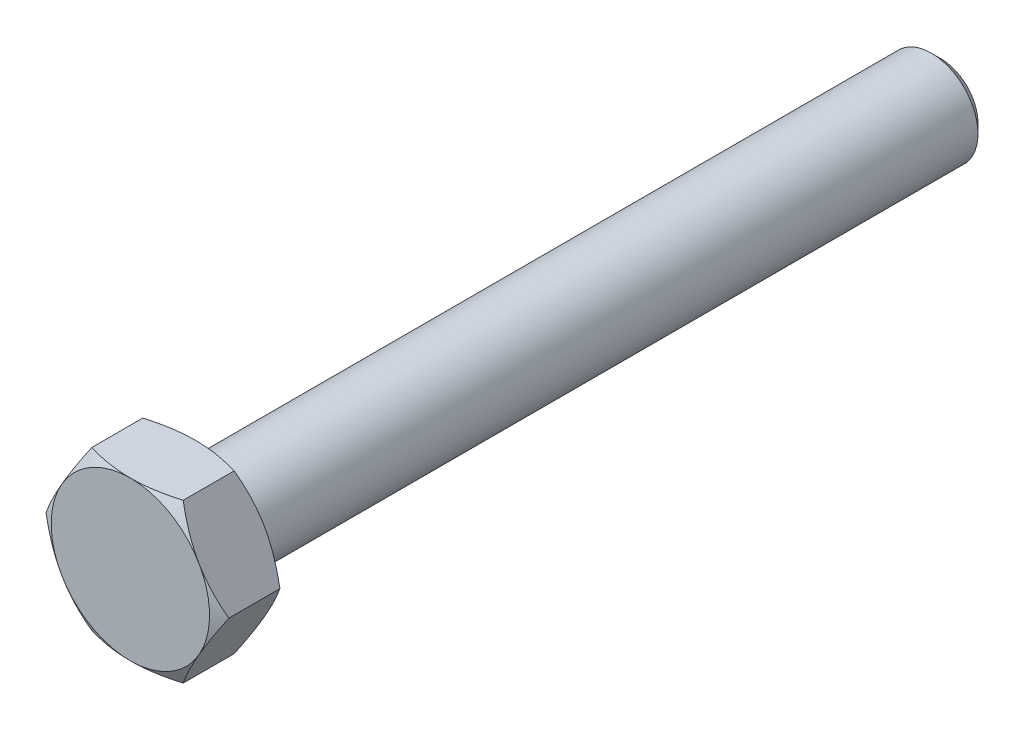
ISO-10303-21;
HEADER;
FILE_DESCRIPTION(('STEP AP214'),'2;1');
FILE_NAME('part.step','',(''),(''),'','','');
FILE_SCHEMA(('AUTOMOTIVE_DESIGN { 1 0 10303 214 1 1 1 1 }'));
ENDSEC;
DATA;
#1=APPLICATION_CONTEXT('core data for automotive mechanical design processes');
#2=APPLICATION_PROTOCOL_DEFINITION('international standard','automotive_design',2000,#1);
#3=PRODUCT_CONTEXT('',#1,'mechanical');
#4=PRODUCT('Part','Part','',(#3));
#5=PRODUCT_RELATED_PRODUCT_CATEGORY('part','',(#4));
#6=PRODUCT_DEFINITION_FORMATION('','',#4);
#7=PRODUCT_DEFINITION_CONTEXT('part definition',#1,'design');
#8=PRODUCT_DEFINITION('design','',#6,#7);
#9=PRODUCT_DEFINITION_SHAPE('','',#8);
#10=(LENGTH_UNIT() NAMED_UNIT(*) SI_UNIT(.MILLI.,.METRE.));
#11=(NAMED_UNIT(*) PLANE_ANGLE_UNIT() SI_UNIT($,.RADIAN.));
#12=(NAMED_UNIT(*) SI_UNIT($,.STERADIAN.) SOLID_ANGLE_UNIT());
#13=UNCERTAINTY_MEASURE_WITH_UNIT(LENGTH_MEASURE(1.E-05),#10,'distance_accuracy_value','');
#14=(GEOMETRIC_REPRESENTATION_CONTEXT(3) GLOBAL_UNCERTAINTY_ASSIGNED_CONTEXT((#13)) GLOBAL_UNIT_ASSIGNED_CONTEXT((#10,
#11,#12)) REPRESENTATION_CONTEXT('',''));
#15=CARTESIAN_POINT('',(0.,0.,0.));
#16=DIRECTION('',(0.,0.,1.));
#17=DIRECTION('',(1.,0.,0.));
#18=AXIS2_PLACEMENT_3D('',#15,#16,#17);
#19=CARTESIAN_POINT('',(-9.81495457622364,0.,0.));
#20=DIRECTION('',(0.,0.,1.));
#21=DIRECTION('',(1.,0.,0.));
#22=AXIS2_PLACEMENT_3D('',#19,#20,#21);
#23=PLANE('',#22);
#24=CARTESIAN_POINT('',(0.,0.,0.));
#25=DIRECTION('',(0.,0.,1.));
#26=DIRECTION('',(1.,0.,0.));
#27=AXIS2_PLACEMENT_3D('',#24,#25,#26);
#28=CIRCLE('',#27,8.5);
#29=CARTESIAN_POINT('',(7.36121593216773,4.25,0.));
#30=VERTEX_POINT('',#29);
#31=CARTESIAN_POINT('',(0.,8.50000000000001,0.));
#32=VERTEX_POINT('',#31);
#33=EDGE_CURVE('E257',#30,#32,#28,.T.);
#34=ORIENTED_EDGE('',*,*,#33,.F.);
#35=CARTESIAN_POINT('',(7.36121593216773,-4.25,0.));
#36=VERTEX_POINT('',#35);
#37=EDGE_CURVE('E266',#36,#30,#28,.T.);
#38=ORIENTED_EDGE('',*,*,#37,.F.);
#39=CARTESIAN_POINT('',(0.,-8.50000000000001,0.));
#40=VERTEX_POINT('',#39);
#41=EDGE_CURVE('E269',#40,#36,#28,.T.);
#42=ORIENTED_EDGE('',*,*,#41,.F.);
#43=CARTESIAN_POINT('',(-7.36121593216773,-4.25,0.));
#44=VERTEX_POINT('',#43);
#45=EDGE_CURVE('E332',#44,#40,#28,.T.);
#46=ORIENTED_EDGE('',*,*,#45,.F.);
#47=CARTESIAN_POINT('',(-7.36121593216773,4.25,0.));
#48=VERTEX_POINT('',#47);
#49=EDGE_CURVE('E339',#48,#44,#28,.T.);
#50=ORIENTED_EDGE('',*,*,#49,.F.);
#51=CARTESIAN_POINT('',(0.,0.,0.));
#52=DIRECTION('',(0.,0.,-1.));
#53=DIRECTION('',(-1.,0.,0.));
#54=AXIS2_PLACEMENT_3D('',#51,#52,#53);
#55=CIRCLE('',#54,8.50000000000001);
#56=EDGE_CURVE('E201',#48,#32,#55,.T.);
#57=ORIENTED_EDGE('',*,*,#56,.T.);
#58=EDGE_LOOP('',(#34,#38,#42,#46,#50,#57));
#59=FACE_BOUND('',#58,.T.);
#60=CARTESIAN_POINT('',(0.,0.,0.));
#61=DIRECTION('',(0.,0.,1.));
#62=DIRECTION('',(1.,0.,0.));
#63=AXIS2_PLACEMENT_3D('',#60,#61,#62);
#64=CIRCLE('',#63,5.);
#65=CARTESIAN_POINT('',(5.,0.,0.));
#66=VERTEX_POINT('',#65);
#67=EDGE_CURVE('E134',#66,#66,#64,.F.);
#68=ORIENTED_EDGE('',*,*,#67,.F.);
#69=EDGE_LOOP('',(#68));
#70=FACE_BOUND('',#69,.T.);
#71=ADVANCED_FACE('F30',(#59,#70),#23,.F.);
#72=CARTESIAN_POINT('',(-9.81495457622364,0.,7.));
#73=DIRECTION('',(-0.866025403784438,0.5,0.));
#74=DIRECTION('',(-0.5,-0.866025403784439,0.));
#75=AXIS2_PLACEMENT_3D('',#72,#73,#74);
#76=PLANE('',#75);
#77=DIRECTION('',(0.,0.,-1.));
#78=VECTOR('',#77,1.);
#79=CARTESIAN_POINT('',(-9.81495457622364,0.,7.));
#80=LINE('',#79,#78);
#81=CARTESIAN_POINT('',(-9.81495457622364,0.,6.24081062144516));
#82=VERTEX_POINT('',#81);
#83=CARTESIAN_POINT('',(-9.81495457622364,0.,0.75918937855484));
#84=VERTEX_POINT('',#83);
#85=EDGE_CURVE('E270',#82,#84,#80,.T.);
#86=ORIENTED_EDGE('',*,*,#85,.F.);
#87=CARTESIAN_POINT('',(-9.81507004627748,-0.000200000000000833,6.24074395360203));
#88=CARTESIAN_POINT('',(-9.70719836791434,0.18663922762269,6.30301386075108));
#89=CARTESIAN_POINT('',(-9.59892450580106,0.374175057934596,6.36245770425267));
#90=CARTESIAN_POINT('',(-9.3814974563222,0.750769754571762,6.47491488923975));
#91=CARTESIAN_POINT('',(-9.27234391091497,0.939829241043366,6.52792545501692));
#92=CARTESIAN_POINT('',(-8.94313560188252,1.5100347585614,6.67626661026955));
#93=CARTESIAN_POINT('',(-8.72178130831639,1.89343164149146,6.76064107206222));
#94=CARTESIAN_POINT('',(-8.39052888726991,2.46717766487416,6.85957998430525));
#95=CARTESIAN_POINT('',(-8.28162036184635,2.65581276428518,6.88776480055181));
#96=CARTESIAN_POINT('',(-8.06331079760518,3.03393602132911,6.9350259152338));
#97=CARTESIAN_POINT('',(-7.95390980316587,3.22342410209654,6.95410301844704));
#98=CARTESIAN_POINT('',(-7.73491944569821,3.6027265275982,6.9826652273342));
#99=CARTESIAN_POINT('',(-7.62533043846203,3.79254025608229,6.99216121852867));
#100=CARTESIAN_POINT('',(-7.40605119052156,4.17234305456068,7.00135762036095));
#101=CARTESIAN_POINT('',(-7.29636095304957,4.36233211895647,7.00105833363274));
#102=CARTESIAN_POINT('',(-7.09129139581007,4.71752301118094,6.9913455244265));
#103=CARTESIAN_POINT('',(-6.99589760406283,4.8827499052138,6.98311683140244));
#104=CARTESIAN_POINT('',(-6.80533344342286,5.21281671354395,6.9594107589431));
#105=CARTESIAN_POINT('',(-6.71016309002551,5.37765660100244,6.9439328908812));
#106=CARTESIAN_POINT('',(-6.42502047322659,5.87153810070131,6.88699137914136));
#107=CARTESIAN_POINT('',(-6.23555293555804,6.19970550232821,6.83502693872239));
#108=CARTESIAN_POINT('',(-5.8546080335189,6.85952142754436,6.70511505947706));
#109=CARTESIAN_POINT('',(-5.66317928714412,7.19108574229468,6.62661693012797));
#110=CARTESIAN_POINT('',(-5.28317649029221,7.84926989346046,6.44845866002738));
#111=CARTESIAN_POINT('',(-5.09459757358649,8.17589815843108,6.34884036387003));
#112=CARTESIAN_POINT('',(-4.90736181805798,8.5002,6.24074395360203));
#113=B_SPLINE_CURVE_WITH_KNOTS('',3,(#87,#88,#89,#90,#91,#92,#93,#94,#95,#96,#97,#98,#99,#100,
#101,#102,#103,#104,#105,#106,#107,#108,#109,#110,#111,#112),.UNSPECIFIED.,.F.,.F.,(4,2,2,2,2,2,
2,2,2,2,2,2,4),(0.,0.673596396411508,1.34748239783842,2.69805431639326,3.356799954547,
4.01548737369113,4.67342558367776,5.33134346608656,5.9040955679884,6.47688628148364,
7.62328361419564,8.79510569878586,9.9646274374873),.UNSPECIFIED.);
#114=CARTESIAN_POINT('',(-7.36121593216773,4.25,7.));
#115=VERTEX_POINT('',#114);
#116=EDGE_CURVE('E372',#82,#115,#113,.T.);
#117=ORIENTED_EDGE('',*,*,#116,.T.);
#118=CARTESIAN_POINT('',(-4.90747728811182,8.5,6.24081062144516));
#119=VERTEX_POINT('',#118);
#120=EDGE_CURVE('E129',#115,#119,#113,.T.);
#121=ORIENTED_EDGE('',*,*,#120,.T.);
#122=DIRECTION('',(0.,0.,-1.));
#123=VECTOR('',#122,1.);
#124=CARTESIAN_POINT('',(-4.90747728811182,8.5,7.));
#125=LINE('',#124,#123);
#126=CARTESIAN_POINT('',(-4.90747728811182,8.5,0.75918937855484));
#127=VERTEX_POINT('',#126);
#128=EDGE_CURVE('E146',#119,#127,#125,.T.);
#129=ORIENTED_EDGE('',*,*,#128,.T.);
#130=CARTESIAN_POINT('',(-4.90736181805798,8.5002,0.759256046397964));
#131=CARTESIAN_POINT('',(-5.01523349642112,8.31336077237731,0.696986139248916));
#132=CARTESIAN_POINT('',(-5.1235073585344,8.1258249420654,0.637542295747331));
#133=CARTESIAN_POINT('',(-5.34093440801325,7.74923024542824,0.525085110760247));
#134=CARTESIAN_POINT('',(-5.45008795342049,7.56017075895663,0.472074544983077));
#135=CARTESIAN_POINT('',(-5.77929626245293,6.9899652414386,0.323733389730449));
#136=CARTESIAN_POINT('',(-6.00065055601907,6.60656835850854,0.239358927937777));
#137=CARTESIAN_POINT('',(-6.33190297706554,6.03282233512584,0.140420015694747));
#138=CARTESIAN_POINT('',(-6.44081150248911,5.84418723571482,0.11223519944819));
#139=CARTESIAN_POINT('',(-6.65912106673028,5.46606397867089,0.0649740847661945));
#140=CARTESIAN_POINT('',(-6.76852206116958,5.27657589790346,0.0458969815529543));
#141=CARTESIAN_POINT('',(-6.98751241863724,4.8972734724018,0.0173347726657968));
#142=CARTESIAN_POINT('',(-7.09710142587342,4.70745974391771,0.0078387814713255));
#143=CARTESIAN_POINT('',(-7.31638067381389,4.32765694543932,-0.00135762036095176));
#144=CARTESIAN_POINT('',(-7.42607091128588,4.13766788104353,-0.00105833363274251));
#145=CARTESIAN_POINT('',(-7.63114046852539,3.78247698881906,0.00865447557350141));
#146=CARTESIAN_POINT('',(-7.72653426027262,3.6172500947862,0.0168831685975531));
#147=CARTESIAN_POINT('',(-7.9170984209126,3.28718328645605,0.0405892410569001));
#148=CARTESIAN_POINT('',(-8.01226877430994,3.12234339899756,0.0560671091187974));
#149=CARTESIAN_POINT('',(-8.29741139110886,2.62846189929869,0.113008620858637));
#150=CARTESIAN_POINT('',(-8.48687892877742,2.30029449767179,0.164973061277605));
#151=CARTESIAN_POINT('',(-8.86782383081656,1.64047857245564,0.294884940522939));
#152=CARTESIAN_POINT('',(-9.05925257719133,1.30891425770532,0.373383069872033));
#153=CARTESIAN_POINT('',(-9.43925537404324,0.650730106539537,0.551541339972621));
#154=CARTESIAN_POINT('',(-9.62783429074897,0.32410184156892,0.651159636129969));
#155=CARTESIAN_POINT('',(-9.81507004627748,-0.000200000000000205,0.759256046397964));
#156=B_SPLINE_CURVE_WITH_KNOTS('',3,(#130,#131,#132,#133,#134,#135,#136,#137,#138,#139,#140,
#141,#142,#143,#144,#145,#146,#147,#148,#149,#150,#151,#152,#153,#154,#155),.UNSPECIFIED.,.F.,
.F.,(4,2,2,2,2,2,2,2,2,2,2,2,4),(0.,0.673596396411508,1.34748239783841,2.69805431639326,
3.356799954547,4.01548737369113,4.67342558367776,5.33134346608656,5.90409556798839,
6.47688628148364,7.62328361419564,8.79510569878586,9.9646274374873),.UNSPECIFIED.);
#157=EDGE_CURVE('E238',#127,#48,#156,.T.);
#158=ORIENTED_EDGE('',*,*,#157,.T.);
#159=EDGE_CURVE('E232',#48,#84,#156,.T.);
#160=ORIENTED_EDGE('',*,*,#159,.T.);
#161=EDGE_LOOP('',(#86,#117,#121,#129,#158,#160));
#162=FACE_BOUND('',#161,.T.);
#163=ADVANCED_FACE('F240',(#162),#76,.T.);
#164=CARTESIAN_POINT('',(-4.90747728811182,-8.5,7.));
#165=DIRECTION('',(-0.866025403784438,-0.5,0.));
#166=DIRECTION('',(0.5,-0.866025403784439,0.));
#167=AXIS2_PLACEMENT_3D('',#164,#165,#166);
#168=PLANE('',#167);
#169=DIRECTION('',(0.,0.,-1.));
#170=VECTOR('',#169,1.);
#171=CARTESIAN_POINT('',(-4.90747728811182,-8.5,7.));
#172=LINE('',#171,#170);
#173=CARTESIAN_POINT('',(-4.90747728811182,-8.5,6.24081062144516));
#174=VERTEX_POINT('',#173);
#175=CARTESIAN_POINT('',(-4.90747728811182,-8.5,0.75918937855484));
#176=VERTEX_POINT('',#175);
#177=EDGE_CURVE('E272',#174,#176,#172,.T.);
#178=ORIENTED_EDGE('',*,*,#177,.F.);
#179=CARTESIAN_POINT('',(-4.90736181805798,-8.5002,6.24074395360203));
#180=CARTESIAN_POINT('',(-5.01523349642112,-8.31336077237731,6.30301386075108));
#181=CARTESIAN_POINT('',(-5.1235073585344,-8.1258249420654,6.36245770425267));
#182=CARTESIAN_POINT('',(-5.34093440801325,-7.74923024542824,6.47491488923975));
#183=CARTESIAN_POINT('',(-5.45008795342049,-7.56017075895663,6.52792545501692));
#184=CARTESIAN_POINT('',(-5.77929626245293,-6.9899652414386,6.67626661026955));
#185=CARTESIAN_POINT('',(-6.00065055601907,-6.60656835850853,6.76064107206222));
#186=CARTESIAN_POINT('',(-6.33190297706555,-6.03282233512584,6.85957998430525));
#187=CARTESIAN_POINT('',(-6.44081150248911,-5.84418723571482,6.88776480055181));
#188=CARTESIAN_POINT('',(-6.65912106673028,-5.46606397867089,6.9350259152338));
#189=CARTESIAN_POINT('',(-6.76852206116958,-5.27657589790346,6.95410301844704));
#190=CARTESIAN_POINT('',(-6.98751241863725,-4.8972734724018,6.9826652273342));
#191=CARTESIAN_POINT('',(-7.09710142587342,-4.70745974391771,6.99216121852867));
#192=CARTESIAN_POINT('',(-7.3163806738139,-4.32765694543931,7.00135762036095));
#193=CARTESIAN_POINT('',(-7.42607091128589,-4.13766788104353,7.00105833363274));
#194=CARTESIAN_POINT('',(-7.63114046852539,-3.78247698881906,6.9913455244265));
#195=CARTESIAN_POINT('',(-7.72653426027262,-3.6172500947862,6.98311683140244));
#196=CARTESIAN_POINT('',(-7.9170984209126,-3.28718328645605,6.9594107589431));
#197=CARTESIAN_POINT('',(-8.01226877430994,-3.12234339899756,6.9439328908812));
#198=CARTESIAN_POINT('',(-8.29741139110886,-2.62846189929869,6.88699137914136));
#199=CARTESIAN_POINT('',(-8.48687892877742,-2.30029449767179,6.83502693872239));
#200=CARTESIAN_POINT('',(-8.86782383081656,-1.64047857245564,6.70511505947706));
#201=CARTESIAN_POINT('',(-9.05925257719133,-1.30891425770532,6.62661693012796));
#202=CARTESIAN_POINT('',(-9.43925537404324,-0.650730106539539,6.44845866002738));
#203=CARTESIAN_POINT('',(-9.62783429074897,-0.324101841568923,6.34884036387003));
#204=CARTESIAN_POINT('',(-9.81507004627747,0.000199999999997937,6.24074395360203));
#205=B_SPLINE_CURVE_WITH_KNOTS('',3,(#179,#180,#181,#182,#183,#184,#185,#186,#187,#188,#189,
#190,#191,#192,#193,#194,#195,#196,#197,#198,#199,#200,#201,#202,#203,#204),.UNSPECIFIED.,.F.,
.F.,(4,2,2,2,2,2,2,2,2,2,2,2,4),(0.,0.673596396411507,1.34748239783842,2.69805431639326,
3.356799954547,4.01548737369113,4.67342558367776,5.33134346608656,5.90409556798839,
6.47688628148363,7.62328361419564,8.79510569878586,9.9646274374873),.UNSPECIFIED.);
#206=CARTESIAN_POINT('',(-7.36121593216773,-4.25,7.));
#207=VERTEX_POINT('',#206);
#208=EDGE_CURVE('E192',#174,#207,#205,.T.);
#209=ORIENTED_EDGE('',*,*,#208,.T.);
#210=EDGE_CURVE('E187',#207,#82,#205,.T.);
#211=ORIENTED_EDGE('',*,*,#210,.T.);
#212=ORIENTED_EDGE('',*,*,#85,.T.);
#213=CARTESIAN_POINT('',(-9.81507004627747,0.000199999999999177,0.759256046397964));
#214=CARTESIAN_POINT('',(-9.70719836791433,-0.186639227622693,0.696986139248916));
#215=CARTESIAN_POINT('',(-9.59892450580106,-0.374175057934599,0.637542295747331));
#216=CARTESIAN_POINT('',(-9.3814974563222,-0.750769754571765,0.525085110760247));
#217=CARTESIAN_POINT('',(-9.27234391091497,-0.939829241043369,0.472074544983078));
#218=CARTESIAN_POINT('',(-8.94313560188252,-1.5100347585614,0.323733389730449));
#219=CARTESIAN_POINT('',(-8.72178130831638,-1.89343164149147,0.239358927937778));
#220=CARTESIAN_POINT('',(-8.39052888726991,-2.46717766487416,0.140420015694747));
#221=CARTESIAN_POINT('',(-8.28162036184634,-2.65581276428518,0.11223519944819));
#222=CARTESIAN_POINT('',(-8.06331079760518,-3.03393602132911,0.0649740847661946));
#223=CARTESIAN_POINT('',(-7.95390980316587,-3.22342410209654,0.0458969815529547));
#224=CARTESIAN_POINT('',(-7.73491944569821,-3.6027265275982,0.0173347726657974));
#225=CARTESIAN_POINT('',(-7.62533043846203,-3.79254025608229,0.00783878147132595));
#226=CARTESIAN_POINT('',(-7.40605119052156,-4.17234305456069,-0.0013576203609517));
#227=CARTESIAN_POINT('',(-7.29636095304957,-4.36233211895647,-0.00105833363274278));
#228=CARTESIAN_POINT('',(-7.09129139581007,-4.71752301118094,0.00865447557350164));
#229=CARTESIAN_POINT('',(-6.99589760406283,-4.8827499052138,0.016883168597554));
#230=CARTESIAN_POINT('',(-6.80533344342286,-5.21281671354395,0.0405892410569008));
#231=CARTESIAN_POINT('',(-6.71016309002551,-5.37765660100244,0.0560671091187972));
#232=CARTESIAN_POINT('',(-6.42502047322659,-5.87153810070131,0.113008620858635));
#233=CARTESIAN_POINT('',(-6.23555293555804,-6.19970550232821,0.164973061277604));
#234=CARTESIAN_POINT('',(-5.8546080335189,-6.85952142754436,0.294884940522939));
#235=CARTESIAN_POINT('',(-5.66317928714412,-7.19108574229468,0.373383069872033));
#236=CARTESIAN_POINT('',(-5.28317649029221,-7.84926989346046,0.551541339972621));
#237=CARTESIAN_POINT('',(-5.09459757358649,-8.17589815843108,0.651159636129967));
#238=CARTESIAN_POINT('',(-4.90736181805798,-8.5002,0.759256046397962));
#239=B_SPLINE_CURVE_WITH_KNOTS('',3,(#213,#214,#215,#216,#217,#218,#219,#220,#221,#222,#223,
#224,#225,#226,#227,#228,#229,#230,#231,#232,#233,#234,#235,#236,#237,#238),.UNSPECIFIED.,.F.,
.F.,(4,2,2,2,2,2,2,2,2,2,2,2,4),(0.,0.673596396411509,1.34748239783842,2.69805431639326,
3.356799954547,4.01548737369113,4.67342558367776,5.33134346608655,5.90409556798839,
6.47688628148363,7.62328361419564,8.79510569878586,9.9646274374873),.UNSPECIFIED.);
#240=EDGE_CURVE('E231',#84,#44,#239,.T.);
#241=ORIENTED_EDGE('',*,*,#240,.T.);
#242=EDGE_CURVE('E225',#44,#176,#239,.T.);
#243=ORIENTED_EDGE('',*,*,#242,.T.);
#244=EDGE_LOOP('',(#178,#209,#211,#212,#241,#243));
#245=FACE_BOUND('',#244,.T.);
#246=ADVANCED_FACE('F32',(#245),#168,.T.);
#247=CARTESIAN_POINT('',(4.90747728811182,-8.5,7.));
#248=DIRECTION('',(0.,-1.,0.));
#249=DIRECTION('',(1.,0.,0.));
#250=AXIS2_PLACEMENT_3D('',#247,#248,#249);
#251=PLANE('',#250);
#252=DIRECTION('',(0.,0.,-1.));
#253=VECTOR('',#252,1.);
#254=CARTESIAN_POINT('',(4.90747728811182,-8.5,7.));
#255=LINE('',#254,#253);
#256=CARTESIAN_POINT('',(4.90747728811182,-8.5,6.24081062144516));
#257=VERTEX_POINT('',#256);
#258=CARTESIAN_POINT('',(4.90747728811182,-8.5,0.759189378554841));
#259=VERTEX_POINT('',#258);
#260=EDGE_CURVE('E274',#257,#259,#255,.T.);
#261=ORIENTED_EDGE('',*,*,#260,.F.);
#262=CARTESIAN_POINT('',(-13.1709506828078,-8.5,2.8571744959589));
#263=CARTESIAN_POINT('',(-12.7965142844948,-8.5,3.03876304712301));
#264=CARTESIAN_POINT('',(-12.4212100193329,-8.5,3.21859351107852));
#265=CARTESIAN_POINT('',(-11.668397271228,-8.5,3.57373710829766));
#266=CARTESIAN_POINT('',(-11.290888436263,-8.5,3.74904949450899));
#267=CARTESIAN_POINT('',(-10.5312343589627,-8.5,4.09504575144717));
#268=CARTESIAN_POINT('',(-10.1490750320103,-8.5,4.265698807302));
#269=CARTESIAN_POINT('',(-9.38167240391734,-8.5,4.59989574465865));
#270=CARTESIAN_POINT('',(-8.99642925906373,-8.5,4.76343998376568));
#271=CARTESIAN_POINT('',(-8.21674950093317,-8.5,5.08377190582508));
#272=CARTESIAN_POINT('',(-7.8222599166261,-8.5,5.2404313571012));
#273=CARTESIAN_POINT('',(-7.02868455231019,-8.5,5.541864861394));
#274=CARTESIAN_POINT('',(-6.62959827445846,-8.5,5.68663761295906));
#275=CARTESIAN_POINT('',(-5.82695890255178,-8.5,5.96052044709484));
#276=CARTESIAN_POINT('',(-5.42341684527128,-8.5,6.08966252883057));
#277=CARTESIAN_POINT('',(-4.61060512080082,-8.5,6.32819304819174));
#278=CARTESIAN_POINT('',(-4.20133725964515,-8.5,6.43758756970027));
#279=CARTESIAN_POINT('',(-3.37679413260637,-8.5,6.63138984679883));
#280=CARTESIAN_POINT('',(-2.96151926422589,-8.5,6.71579924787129));
#281=CARTESIAN_POINT('',(-2.33482412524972,-8.5,6.81954164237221));
#282=CARTESIAN_POINT('',(-2.12527044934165,-8.5,6.85031275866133));
#283=CARTESIAN_POINT('',(-1.70512593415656,-8.5,6.90362900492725));
#284=CARTESIAN_POINT('',(-1.49453519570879,-8.5,6.92617491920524));
#285=CARTESIAN_POINT('',(-1.07402720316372,-8.5,6.96242566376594));
#286=CARTESIAN_POINT('',(-0.864115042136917,-8.5,6.97618931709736));
#287=CARTESIAN_POINT('',(-0.443896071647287,-8.5,6.99480106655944));
#288=CARTESIAN_POINT('',(-0.233589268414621,-8.5,6.99964930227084));
#289=CARTESIAN_POINT('',(0.186977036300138,-8.5,7.00031380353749));
#290=CARTESIAN_POINT('',(0.397236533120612,-8.5,6.99613276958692));
#291=CARTESIAN_POINT('',(0.817391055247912,-8.5,6.97884687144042));
#292=CARTESIAN_POINT('',(1.02728606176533,-8.5,6.96574156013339));
#293=CARTESIAN_POINT('',(1.5309570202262,-8.5,6.92386411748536));
#294=CARTESIAN_POINT('',(1.82439191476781,-8.5,6.8909033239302));
#295=CARTESIAN_POINT('',(2.40906617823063,-8.5,6.80933973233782));
#296=CARTESIAN_POINT('',(2.70030523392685,-8.5,6.76073474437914));
#297=CARTESIAN_POINT('',(3.57118710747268,-8.5,6.59387904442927));
#298=CARTESIAN_POINT('',(4.14687091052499,-8.5,6.45469323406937));
#299=CARTESIAN_POINT('',(5.00829204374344,-8.5,6.21339179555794));
#300=CARTESIAN_POINT('',(5.2984963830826,-8.5,6.12630719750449));
#301=CARTESIAN_POINT('',(5.87610340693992,-8.5,5.94312794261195));
#302=CARTESIAN_POINT('',(6.16350582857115,-8.5,5.84703244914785));
#303=CARTESIAN_POINT('',(6.73408033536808,-8.5,5.64791497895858));
#304=CARTESIAN_POINT('',(7.01726706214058,-8.5,5.54493452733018));
#305=CARTESIAN_POINT('',(7.58120624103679,-8.5,5.33279440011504));
#306=CARTESIAN_POINT('',(7.86195952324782,-8.5,5.22363693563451));
#307=CARTESIAN_POINT('',(8.14168397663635,-8.5,5.11196362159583));
#308=B_SPLINE_CURVE_WITH_KNOTS('',3,(#262,#263,#264,#265,#266,#267,#268,#269,#270,#271,#272,
#273,#274,#275,#276,#277,#278,#279,#280,#281,#282,#283,#284,#285,#286,#287,#288,#289,#290,#291,
#292,#293,#294,#295,#296,#297,#298,#299,#300,#301,#302,#303,#304,#305,#306,#307),.UNSPECIFIED.,
.F.,.F.,(4,2,2,2,2,2,2,2,2,2,2,2,2,2,2,2,2,2,2,2,2,2,4),(0.,1.24845219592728,2.49710951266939,
3.75264488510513,5.00811702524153,6.28134099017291,7.55470417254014,8.82541477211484,
10.095733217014,11.3659679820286,12.0012345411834,12.6364405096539,13.2673459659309,
13.8982415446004,14.5289484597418,15.1596869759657,16.0450283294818,16.9304936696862,
18.7047951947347,19.6136865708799,20.5226624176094,21.4265794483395,22.3301749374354),.UNSPECIFIED.);
#309=CARTESIAN_POINT('',(0.,-8.5,7.));
#310=VERTEX_POINT('',#309);
#311=EDGE_CURVE('E199',#257,#310,#308,.F.);
#312=ORIENTED_EDGE('',*,*,#311,.T.);
#313=EDGE_CURVE('E193',#310,#174,#308,.F.);
#314=ORIENTED_EDGE('',*,*,#313,.T.);
#315=ORIENTED_EDGE('',*,*,#177,.T.);
#316=CARTESIAN_POINT('',(-13.1709506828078,-8.5,4.1428255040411));
#317=CARTESIAN_POINT('',(-12.7965142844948,-8.5,3.96123695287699));
#318=CARTESIAN_POINT('',(-12.4212100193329,-8.5,3.78140648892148));
#319=CARTESIAN_POINT('',(-11.668397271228,-8.5,3.42626289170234));
#320=CARTESIAN_POINT('',(-11.290888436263,-8.5,3.25095050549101));
#321=CARTESIAN_POINT('',(-10.5312343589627,-8.5,2.90495424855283));
#322=CARTESIAN_POINT('',(-10.1490750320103,-8.5,2.734301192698));
#323=CARTESIAN_POINT('',(-9.38167240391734,-8.5,2.40010425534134));
#324=CARTESIAN_POINT('',(-8.99642925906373,-8.5,2.23656001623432));
#325=CARTESIAN_POINT('',(-8.21674950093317,-8.5,1.91622809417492));
#326=CARTESIAN_POINT('',(-7.8222599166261,-8.5,1.7595686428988));
#327=CARTESIAN_POINT('',(-7.0286845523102,-8.5,1.458135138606));
#328=CARTESIAN_POINT('',(-6.62959827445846,-8.5,1.31336238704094));
#329=CARTESIAN_POINT('',(-5.82695890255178,-8.5,1.03947955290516));
#330=CARTESIAN_POINT('',(-5.42341684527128,-8.5,0.910337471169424));
#331=CARTESIAN_POINT('',(-4.61060512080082,-8.5,0.671806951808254));
#332=CARTESIAN_POINT('',(-4.20133725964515,-8.5,0.562412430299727));
#333=CARTESIAN_POINT('',(-3.37679413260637,-8.5,0.368610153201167));
#334=CARTESIAN_POINT('',(-2.96151926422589,-8.5,0.284200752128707));
#335=CARTESIAN_POINT('',(-2.33482412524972,-8.5,0.180458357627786));
#336=CARTESIAN_POINT('',(-2.12527044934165,-8.5,0.149687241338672));
#337=CARTESIAN_POINT('',(-1.70512593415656,-8.5,0.0963709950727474));
#338=CARTESIAN_POINT('',(-1.49453519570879,-8.5,0.0738250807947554));
#339=CARTESIAN_POINT('',(-1.07402720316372,-8.5,0.0375743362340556));
#340=CARTESIAN_POINT('',(-0.864115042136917,-8.5,0.0238106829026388));
#341=CARTESIAN_POINT('',(-0.443896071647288,-8.5,0.00519893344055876));
#342=CARTESIAN_POINT('',(-0.233589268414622,-8.5,0.000350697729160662));
#343=CARTESIAN_POINT('',(0.186977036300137,-8.5,-0.000313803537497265));
#344=CARTESIAN_POINT('',(0.397236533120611,-8.5,0.00386723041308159));
#345=CARTESIAN_POINT('',(0.817391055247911,-8.5,0.0211531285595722));
#346=CARTESIAN_POINT('',(1.02728606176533,-8.5,0.0342584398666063));
#347=CARTESIAN_POINT('',(1.5309570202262,-8.5,0.076135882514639));
#348=CARTESIAN_POINT('',(1.82439191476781,-8.5,0.109096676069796));
#349=CARTESIAN_POINT('',(2.40906617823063,-8.5,0.190660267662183));
#350=CARTESIAN_POINT('',(2.70030523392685,-8.5,0.239265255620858));
#351=CARTESIAN_POINT('',(3.57118710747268,-8.5,0.406120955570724));
#352=CARTESIAN_POINT('',(4.14687091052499,-8.5,0.545306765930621));
#353=CARTESIAN_POINT('',(5.00829204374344,-8.5,0.786608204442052));
#354=CARTESIAN_POINT('',(5.2984963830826,-8.5,0.873692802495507));
#355=CARTESIAN_POINT('',(5.87610340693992,-8.5,1.05687205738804));
#356=CARTESIAN_POINT('',(6.16350582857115,-8.5,1.15296755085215));
#357=CARTESIAN_POINT('',(6.73408033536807,-8.5,1.35208502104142));
#358=CARTESIAN_POINT('',(7.01726706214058,-8.5,1.45506547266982));
#359=CARTESIAN_POINT('',(7.58120624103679,-8.5,1.66720559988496));
#360=CARTESIAN_POINT('',(7.86195952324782,-8.5,1.77636306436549));
#361=CARTESIAN_POINT('',(8.14168397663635,-8.5,1.88803637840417));
#362=B_SPLINE_CURVE_WITH_KNOTS('',3,(#316,#317,#318,#319,#320,#321,#322,#323,#324,#325,#326,
#327,#328,#329,#330,#331,#332,#333,#334,#335,#336,#337,#338,#339,#340,#341,#342,#343,#344,#345,
#346,#347,#348,#349,#350,#351,#352,#353,#354,#355,#356,#357,#358,#359,#360,#361),.UNSPECIFIED.,
.F.,.F.,(4,2,2,2,2,2,2,2,2,2,2,2,2,2,2,2,2,2,2,2,2,2,4),(0.,1.24845219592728,2.49710951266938,
3.75264488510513,5.00811702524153,6.28134099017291,7.55470417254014,8.82541477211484,
10.095733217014,11.3659679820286,12.0012345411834,12.6364405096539,13.2673459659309,
13.8982415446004,14.5289484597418,15.1596869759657,16.0450283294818,16.9304936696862,
18.7047951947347,19.6136865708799,20.5226624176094,21.4265794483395,22.3301749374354),.UNSPECIFIED.);
#363=EDGE_CURVE('E218',#176,#40,#362,.T.);
#364=ORIENTED_EDGE('',*,*,#363,.T.);
#365=EDGE_CURVE('E211',#40,#259,#362,.T.);
#366=ORIENTED_EDGE('',*,*,#365,.T.);
#367=EDGE_LOOP('',(#261,#312,#314,#315,#364,#366));
#368=FACE_BOUND('',#367,.T.);
#369=ADVANCED_FACE('F203',(#368),#251,.T.);
#370=CARTESIAN_POINT('',(9.81495457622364,0.,7.));
#371=DIRECTION('',(0.866025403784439,-0.5,0.));
#372=DIRECTION('',(0.5,0.866025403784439,0.));
#373=AXIS2_PLACEMENT_3D('',#370,#371,#372);
#374=PLANE('',#373);
#375=DIRECTION('',(0.,0.,-1.));
#376=VECTOR('',#375,1.);
#377=CARTESIAN_POINT('',(9.81495457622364,0.,7.));
#378=LINE('',#377,#376);
#379=CARTESIAN_POINT('',(9.81495457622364,0.,6.24081062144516));
#380=VERTEX_POINT('',#379);
#381=CARTESIAN_POINT('',(9.81495457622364,0.,0.759189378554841));
#382=VERTEX_POINT('',#381);
#383=EDGE_CURVE('E276',#380,#382,#378,.T.);
#384=ORIENTED_EDGE('',*,*,#383,.F.);
#385=CARTESIAN_POINT('',(9.81507004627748,0.00020000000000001,6.24074395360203));
#386=CARTESIAN_POINT('',(9.70719836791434,-0.186639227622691,6.30301386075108));
#387=CARTESIAN_POINT('',(9.59892450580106,-0.374175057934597,6.36245770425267));
#388=CARTESIAN_POINT('',(9.3814974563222,-0.750769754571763,6.47491488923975));
#389=CARTESIAN_POINT('',(9.27234391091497,-0.939829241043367,6.52792545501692));
#390=CARTESIAN_POINT('',(8.94313560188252,-1.5100347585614,6.67626661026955));
#391=CARTESIAN_POINT('',(8.72178130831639,-1.89343164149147,6.76064107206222));
#392=CARTESIAN_POINT('',(8.39052888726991,-2.46717766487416,6.85957998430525));
#393=CARTESIAN_POINT('',(8.28162036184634,-2.65581276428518,6.88776480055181));
#394=CARTESIAN_POINT('',(8.06331079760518,-3.03393602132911,6.9350259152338));
#395=CARTESIAN_POINT('',(7.95390980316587,-3.22342410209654,6.95410301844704));
#396=CARTESIAN_POINT('',(7.73491944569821,-3.6027265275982,6.9826652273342));
#397=CARTESIAN_POINT('',(7.62533043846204,-3.79254025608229,6.99216121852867));
#398=CARTESIAN_POINT('',(7.40605119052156,-4.17234305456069,7.00135762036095));
#399=CARTESIAN_POINT('',(7.29636095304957,-4.36233211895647,7.00105833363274));
#400=CARTESIAN_POINT('',(7.09129139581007,-4.71752301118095,6.99134552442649));
#401=CARTESIAN_POINT('',(6.99589760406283,-4.8827499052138,6.98311683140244));
#402=CARTESIAN_POINT('',(6.80533344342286,-5.21281671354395,6.95941075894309));
#403=CARTESIAN_POINT('',(6.71016309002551,-5.37765660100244,6.9439328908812));
#404=CARTESIAN_POINT('',(6.42502047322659,-5.87153810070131,6.88699137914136));
#405=CARTESIAN_POINT('',(6.23555293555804,-6.19970550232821,6.83502693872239));
#406=CARTESIAN_POINT('',(5.8546080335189,-6.85952142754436,6.70511505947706));
#407=CARTESIAN_POINT('',(5.66317928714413,-7.19108574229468,6.62661693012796));
#408=CARTESIAN_POINT('',(5.28317649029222,-7.84926989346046,6.44845866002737));
#409=CARTESIAN_POINT('',(5.09459757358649,-8.17589815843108,6.34884036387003));
#410=CARTESIAN_POINT('',(4.90736181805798,-8.5002,6.24074395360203));
#411=B_SPLINE_CURVE_WITH_KNOTS('',3,(#385,#386,#387,#388,#389,#390,#391,#392,#393,#394,#395,
#396,#397,#398,#399,#400,#401,#402,#403,#404,#405,#406,#407,#408,#409,#410),.UNSPECIFIED.,.F.,
.F.,(4,2,2,2,2,2,2,2,2,2,2,2,4),(0.,0.673596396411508,1.34748239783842,2.69805431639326,
3.356799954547,4.01548737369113,4.67342558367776,5.33134346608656,5.9040955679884,
6.47688628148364,7.62328361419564,8.79510569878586,9.9646274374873),.UNSPECIFIED.);
#412=CARTESIAN_POINT('',(7.36121593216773,-4.25,7.));
#413=VERTEX_POINT('',#412);
#414=EDGE_CURVE('E181',#380,#413,#411,.T.);
#415=ORIENTED_EDGE('',*,*,#414,.T.);
#416=EDGE_CURVE('E200',#413,#257,#411,.T.);
#417=ORIENTED_EDGE('',*,*,#416,.T.);
#418=ORIENTED_EDGE('',*,*,#260,.T.);
#419=CARTESIAN_POINT('',(4.90736181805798,-8.5002,0.759256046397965));
#420=CARTESIAN_POINT('',(5.01523349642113,-8.31336077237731,0.696986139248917));
#421=CARTESIAN_POINT('',(5.1235073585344,-8.1258249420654,0.637542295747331));
#422=CARTESIAN_POINT('',(5.34093440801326,-7.74923024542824,0.525085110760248));
#423=CARTESIAN_POINT('',(5.45008795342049,-7.56017075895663,0.472074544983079));
#424=CARTESIAN_POINT('',(5.77929626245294,-6.9899652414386,0.323733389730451));
#425=CARTESIAN_POINT('',(6.00065055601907,-6.60656835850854,0.239358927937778));
#426=CARTESIAN_POINT('',(6.33190297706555,-6.03282233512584,0.140420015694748));
#427=CARTESIAN_POINT('',(6.44081150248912,-5.84418723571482,0.112235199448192));
#428=CARTESIAN_POINT('',(6.65912106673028,-5.46606397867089,0.0649740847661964));
#429=CARTESIAN_POINT('',(6.76852206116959,-5.27657589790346,0.0458969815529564));
#430=CARTESIAN_POINT('',(6.98751241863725,-4.8972734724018,0.0173347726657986));
#431=CARTESIAN_POINT('',(7.09710142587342,-4.70745974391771,0.00783878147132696));
#432=CARTESIAN_POINT('',(7.3163806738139,-4.32765694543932,-0.00135762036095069));
#433=CARTESIAN_POINT('',(7.42607091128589,-4.13766788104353,-0.00105833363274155));
#434=CARTESIAN_POINT('',(7.63114046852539,-3.78247698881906,0.00865447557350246));
#435=CARTESIAN_POINT('',(7.72653426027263,-3.6172500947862,0.0168831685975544));
#436=CARTESIAN_POINT('',(7.9170984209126,-3.28718328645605,0.0405892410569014));
#437=CARTESIAN_POINT('',(8.01226877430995,-3.12234339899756,0.0560671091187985));
#438=CARTESIAN_POINT('',(8.29741139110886,-2.62846189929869,0.113008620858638));
#439=CARTESIAN_POINT('',(8.48687892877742,-2.30029449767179,0.164973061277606));
#440=CARTESIAN_POINT('',(8.86782383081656,-1.64047857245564,0.294884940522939));
#441=CARTESIAN_POINT('',(9.05925257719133,-1.30891425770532,0.373383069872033));
#442=CARTESIAN_POINT('',(9.43925537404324,-0.65073010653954,0.551541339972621));
#443=CARTESIAN_POINT('',(9.62783429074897,-0.324101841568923,0.651159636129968));
#444=CARTESIAN_POINT('',(9.81507004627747,0.000199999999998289,0.759256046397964));
#445=B_SPLINE_CURVE_WITH_KNOTS('',3,(#419,#420,#421,#422,#423,#424,#425,#426,#427,#428,#429,
#430,#431,#432,#433,#434,#435,#436,#437,#438,#439,#440,#441,#442,#443,#444),.UNSPECIFIED.,.F.,
.F.,(4,2,2,2,2,2,2,2,2,2,2,2,4),(0.,0.673596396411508,1.34748239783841,2.69805431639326,
3.356799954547,4.01548737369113,4.67342558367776,5.33134346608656,5.90409556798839,
6.47688628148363,7.62328361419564,8.79510569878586,9.9646274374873),.UNSPECIFIED.);
#446=EDGE_CURVE('E219',#259,#36,#445,.T.);
#447=ORIENTED_EDGE('',*,*,#446,.T.);
#448=EDGE_CURVE('E220',#36,#382,#445,.T.);
#449=ORIENTED_EDGE('',*,*,#448,.T.);
#450=EDGE_LOOP('',(#384,#415,#417,#418,#447,#449));
#451=FACE_BOUND('',#450,.T.);
#452=ADVANCED_FACE('F206',(#451),#374,.T.);
#453=CARTESIAN_POINT('',(4.90747728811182,8.5,7.));
#454=DIRECTION('',(0.866025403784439,0.5,0.));
#455=DIRECTION('',(-0.5,0.866025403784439,0.));
#456=AXIS2_PLACEMENT_3D('',#453,#454,#455);
#457=PLANE('',#456);
#458=DIRECTION('',(0.,0.,-1.));
#459=VECTOR('',#458,1.);
#460=CARTESIAN_POINT('',(4.90747728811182,8.5,7.));
#461=LINE('',#460,#459);
#462=CARTESIAN_POINT('',(4.90747728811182,8.5,6.24081062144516));
#463=VERTEX_POINT('',#462);
#464=CARTESIAN_POINT('',(4.90747728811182,8.5,0.759189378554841));
#465=VERTEX_POINT('',#464);
#466=EDGE_CURVE('E277',#463,#465,#461,.T.);
#467=ORIENTED_EDGE('',*,*,#466,.F.);
#468=CARTESIAN_POINT('',(4.90736181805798,8.5002,6.24074395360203));
#469=CARTESIAN_POINT('',(5.01523349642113,8.31336077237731,6.30301386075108));
#470=CARTESIAN_POINT('',(5.1235073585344,8.1258249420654,6.36245770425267));
#471=CARTESIAN_POINT('',(5.34093440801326,7.74923024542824,6.47491488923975));
#472=CARTESIAN_POINT('',(5.45008795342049,7.56017075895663,6.52792545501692));
#473=CARTESIAN_POINT('',(5.77929626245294,6.9899652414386,6.67626661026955));
#474=CARTESIAN_POINT('',(6.00065055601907,6.60656835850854,6.76064107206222));
#475=CARTESIAN_POINT('',(6.33190297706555,6.03282233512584,6.85957998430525));
#476=CARTESIAN_POINT('',(6.44081150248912,5.84418723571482,6.88776480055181));
#477=CARTESIAN_POINT('',(6.65912106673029,5.46606397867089,6.9350259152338));
#478=CARTESIAN_POINT('',(6.76852206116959,5.27657589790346,6.95410301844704));
#479=CARTESIAN_POINT('',(6.98751241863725,4.8972734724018,6.9826652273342));
#480=CARTESIAN_POINT('',(7.09710142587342,4.70745974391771,6.99216121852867));
#481=CARTESIAN_POINT('',(7.3163806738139,4.32765694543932,7.00135762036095));
#482=CARTESIAN_POINT('',(7.42607091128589,4.13766788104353,7.00105833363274));
#483=CARTESIAN_POINT('',(7.63114046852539,3.78247698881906,6.99134552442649));
#484=CARTESIAN_POINT('',(7.72653426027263,3.6172500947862,6.98311683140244));
#485=CARTESIAN_POINT('',(7.9170984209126,3.28718328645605,6.9594107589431));
#486=CARTESIAN_POINT('',(8.01226877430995,3.12234339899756,6.9439328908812));
#487=CARTESIAN_POINT('',(8.29741139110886,2.62846189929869,6.88699137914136));
#488=CARTESIAN_POINT('',(8.48687892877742,2.30029449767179,6.83502693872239));
#489=CARTESIAN_POINT('',(8.86782383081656,1.64047857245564,6.70511505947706));
#490=CARTESIAN_POINT('',(9.05925257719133,1.30891425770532,6.62661693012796));
#491=CARTESIAN_POINT('',(9.43925537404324,0.650730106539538,6.44845866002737));
#492=CARTESIAN_POINT('',(9.62783429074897,0.324101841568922,6.34884036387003));
#493=CARTESIAN_POINT('',(9.81507004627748,-0.000199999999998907,6.24074395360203));
#494=B_SPLINE_CURVE_WITH_KNOTS('',3,(#468,#469,#470,#471,#472,#473,#474,#475,#476,#477,#478,
#479,#480,#481,#482,#483,#484,#485,#486,#487,#488,#489,#490,#491,#492,#493),.UNSPECIFIED.,.F.,
.F.,(4,2,2,2,2,2,2,2,2,2,2,2,4),(0.,0.673596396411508,1.34748239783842,2.69805431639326,
3.356799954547,4.01548737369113,4.67342558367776,5.33134346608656,5.9040955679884,
6.47688628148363,7.62328361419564,8.79510569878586,9.9646274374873),.UNSPECIFIED.);
#495=CARTESIAN_POINT('',(7.36121593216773,4.25,7.));
#496=VERTEX_POINT('',#495);
#497=EDGE_CURVE('E50',#463,#496,#494,.T.);
#498=ORIENTED_EDGE('',*,*,#497,.T.);
#499=EDGE_CURVE('E148',#496,#380,#494,.T.);
#500=ORIENTED_EDGE('',*,*,#499,.T.);
#501=ORIENTED_EDGE('',*,*,#383,.T.);
#502=CARTESIAN_POINT('',(9.81507004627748,-0.0002,0.759256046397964));
#503=CARTESIAN_POINT('',(9.70719836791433,0.186639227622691,0.696986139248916));
#504=CARTESIAN_POINT('',(9.59892450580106,0.374175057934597,0.63754229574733));
#505=CARTESIAN_POINT('',(9.3814974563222,0.750769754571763,0.525085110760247));
#506=CARTESIAN_POINT('',(9.27234391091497,0.939829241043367,0.472074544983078));
#507=CARTESIAN_POINT('',(8.94313560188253,1.5100347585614,0.323733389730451));
#508=CARTESIAN_POINT('',(8.72178130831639,1.89343164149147,0.239358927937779));
#509=CARTESIAN_POINT('',(8.39052888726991,2.46717766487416,0.140420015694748));
#510=CARTESIAN_POINT('',(8.28162036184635,2.65581276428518,0.112235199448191));
#511=CARTESIAN_POINT('',(8.06331079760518,3.03393602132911,0.0649740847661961));
#512=CARTESIAN_POINT('',(7.95390980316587,3.22342410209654,0.0458969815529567));
#513=CARTESIAN_POINT('',(7.73491944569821,3.6027265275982,0.0173347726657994));
#514=CARTESIAN_POINT('',(7.62533043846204,3.79254025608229,0.00783878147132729));
#515=CARTESIAN_POINT('',(7.40605119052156,4.17234305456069,-0.00135762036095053));
#516=CARTESIAN_POINT('',(7.29636095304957,4.36233211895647,-0.00105833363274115));
#517=CARTESIAN_POINT('',(7.09129139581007,4.71752301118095,0.00865447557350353));
#518=CARTESIAN_POINT('',(6.99589760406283,4.8827499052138,0.0168831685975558));
#519=CARTESIAN_POINT('',(6.80533344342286,5.21281671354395,0.0405892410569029));
#520=CARTESIAN_POINT('',(6.71016309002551,5.37765660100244,0.0560671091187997));
#521=CARTESIAN_POINT('',(6.42502047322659,5.87153810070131,0.113008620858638));
#522=CARTESIAN_POINT('',(6.23555293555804,6.19970550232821,0.164973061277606));
#523=CARTESIAN_POINT('',(5.8546080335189,6.85952142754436,0.29488494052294));
#524=CARTESIAN_POINT('',(5.66317928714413,7.19108574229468,0.373383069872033));
#525=CARTESIAN_POINT('',(5.28317649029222,7.84926989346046,0.551541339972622));
#526=CARTESIAN_POINT('',(5.09459757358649,8.17589815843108,0.651159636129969));
#527=CARTESIAN_POINT('',(4.90736181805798,8.5002,0.759256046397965));
#528=B_SPLINE_CURVE_WITH_KNOTS('',3,(#502,#503,#504,#505,#506,#507,#508,#509,#510,#511,#512,
#513,#514,#515,#516,#517,#518,#519,#520,#521,#522,#523,#524,#525,#526,#527),.UNSPECIFIED.,.F.,
.F.,(4,2,2,2,2,2,2,2,2,2,2,2,4),(0.,0.673596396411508,1.34748239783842,2.69805431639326,
3.356799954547,4.01548737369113,4.67342558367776,5.33134346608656,5.90409556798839,
6.47688628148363,7.62328361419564,8.79510569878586,9.9646274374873),.UNSPECIFIED.);
#529=EDGE_CURVE('E297',#382,#30,#528,.T.);
#530=ORIENTED_EDGE('',*,*,#529,.T.);
#531=EDGE_CURVE('E289',#30,#465,#528,.T.);
#532=ORIENTED_EDGE('',*,*,#531,.T.);
#533=EDGE_LOOP('',(#467,#498,#500,#501,#530,#532));
#534=FACE_BOUND('',#533,.T.);
#535=ADVANCED_FACE('F298',(#534),#457,.T.);
#536=CARTESIAN_POINT('',(-4.90747728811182,8.5,7.));
#537=DIRECTION('',(0.,1.,0.));
#538=DIRECTION('',(0.,0.,1.));
#539=AXIS2_PLACEMENT_3D('',#536,#537,#538);
#540=PLANE('',#539);
#541=ORIENTED_EDGE('',*,*,#128,.F.);
#542=CARTESIAN_POINT('',(-13.1709506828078,8.5,2.8571744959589));
#543=CARTESIAN_POINT('',(-12.7965142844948,8.5,3.03876304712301));
#544=CARTESIAN_POINT('',(-12.4212100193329,8.5,3.21859351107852));
#545=CARTESIAN_POINT('',(-11.668397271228,8.5,3.57373710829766));
#546=CARTESIAN_POINT('',(-11.290888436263,8.5,3.74904949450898));
#547=CARTESIAN_POINT('',(-10.5312343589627,8.5,4.09504575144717));
#548=CARTESIAN_POINT('',(-10.1490750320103,8.5,4.265698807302));
#549=CARTESIAN_POINT('',(-9.38167240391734,8.5,4.59989574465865));
#550=CARTESIAN_POINT('',(-8.99642925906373,8.5,4.76343998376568));
#551=CARTESIAN_POINT('',(-8.21674950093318,8.5,5.08377190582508));
#552=CARTESIAN_POINT('',(-7.8222599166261,8.5,5.24043135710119));
#553=CARTESIAN_POINT('',(-7.0286845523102,8.5,5.541864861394));
#554=CARTESIAN_POINT('',(-6.62959827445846,8.5,5.68663761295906));
#555=CARTESIAN_POINT('',(-5.82695890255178,8.5,5.96052044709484));
#556=CARTESIAN_POINT('',(-5.42341684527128,8.5,6.08966252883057));
#557=CARTESIAN_POINT('',(-4.61060512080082,8.5,6.32819304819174));
#558=CARTESIAN_POINT('',(-4.20133725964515,8.5,6.43758756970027));
#559=CARTESIAN_POINT('',(-3.37679413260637,8.5,6.63138984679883));
#560=CARTESIAN_POINT('',(-2.96151926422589,8.5,6.71579924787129));
#561=CARTESIAN_POINT('',(-2.33482412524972,8.5,6.81954164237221));
#562=CARTESIAN_POINT('',(-2.12527044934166,8.5,6.85031275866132));
#563=CARTESIAN_POINT('',(-1.70512593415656,8.5,6.90362900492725));
#564=CARTESIAN_POINT('',(-1.49453519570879,8.5,6.92617491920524));
#565=CARTESIAN_POINT('',(-1.07402720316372,8.5,6.96242566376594));
#566=CARTESIAN_POINT('',(-0.864115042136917,8.5,6.97618931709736));
#567=CARTESIAN_POINT('',(-0.443896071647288,8.5,6.99480106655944));
#568=CARTESIAN_POINT('',(-0.233589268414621,8.5,6.99964930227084));
#569=CARTESIAN_POINT('',(0.186977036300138,8.5,7.00031380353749));
#570=CARTESIAN_POINT('',(0.397236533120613,8.5,6.99613276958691));
#571=CARTESIAN_POINT('',(0.817391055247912,8.5,6.97884687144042));
#572=CARTESIAN_POINT('',(1.02728606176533,8.5,6.96574156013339));
#573=CARTESIAN_POINT('',(1.5309570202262,8.5,6.92386411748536));
#574=CARTESIAN_POINT('',(1.82439191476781,8.5,6.8909033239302));
#575=CARTESIAN_POINT('',(2.40906617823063,8.5,6.80933973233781));
#576=CARTESIAN_POINT('',(2.70030523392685,8.5,6.76073474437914));
#577=CARTESIAN_POINT('',(3.57118710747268,8.5,6.59387904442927));
#578=CARTESIAN_POINT('',(4.14687091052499,8.5,6.45469323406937));
#579=CARTESIAN_POINT('',(5.00829204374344,8.5,6.21339179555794));
#580=CARTESIAN_POINT('',(5.2984963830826,8.5,6.12630719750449));
#581=CARTESIAN_POINT('',(5.87610340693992,8.5,5.94312794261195));
#582=CARTESIAN_POINT('',(6.16350582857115,8.5,5.84703244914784));
#583=CARTESIAN_POINT('',(6.73408033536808,8.5,5.64791497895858));
#584=CARTESIAN_POINT('',(7.01726706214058,8.5,5.54493452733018));
#585=CARTESIAN_POINT('',(7.58120624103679,8.5,5.33279440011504));
#586=CARTESIAN_POINT('',(7.86195952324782,8.5,5.22363693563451));
#587=CARTESIAN_POINT('',(8.14168397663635,8.5,5.11196362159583));
#588=B_SPLINE_CURVE_WITH_KNOTS('',3,(#542,#543,#544,#545,#546,#547,#548,#549,#550,#551,#552,
#553,#554,#555,#556,#557,#558,#559,#560,#561,#562,#563,#564,#565,#566,#567,#568,#569,#570,#571,
#572,#573,#574,#575,#576,#577,#578,#579,#580,#581,#582,#583,#584,#585,#586,#587),.UNSPECIFIED.,
.F.,.F.,(4,2,2,2,2,2,2,2,2,2,2,2,2,2,2,2,2,2,2,2,2,2,4),(0.,1.24845219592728,2.49710951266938,
3.75264488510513,5.00811702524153,6.28134099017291,7.55470417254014,8.82541477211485,
10.095733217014,11.3659679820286,12.0012345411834,12.6364405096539,13.2673459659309,
13.8982415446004,14.5289484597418,15.1596869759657,16.0450283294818,16.9304936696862,
18.7047951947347,19.6136865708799,20.5226624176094,21.4265794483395,22.3301749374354),.UNSPECIFIED.);
#589=CARTESIAN_POINT('',(0.,8.5,7.));
#590=VERTEX_POINT('',#589);
#591=EDGE_CURVE('E122',#119,#590,#588,.T.);
#592=ORIENTED_EDGE('',*,*,#591,.T.);
#593=EDGE_CURVE('E116',#590,#463,#588,.T.);
#594=ORIENTED_EDGE('',*,*,#593,.T.);
#595=ORIENTED_EDGE('',*,*,#466,.T.);
#596=CARTESIAN_POINT('',(-13.1709506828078,8.5,4.1428255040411));
#597=CARTESIAN_POINT('',(-12.7965142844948,8.5,3.96123695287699));
#598=CARTESIAN_POINT('',(-12.4212100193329,8.5,3.78140648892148));
#599=CARTESIAN_POINT('',(-11.668397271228,8.5,3.42626289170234));
#600=CARTESIAN_POINT('',(-11.290888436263,8.5,3.25095050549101));
#601=CARTESIAN_POINT('',(-10.5312343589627,8.5,2.90495424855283));
#602=CARTESIAN_POINT('',(-10.1490750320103,8.5,2.734301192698));
#603=CARTESIAN_POINT('',(-9.38167240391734,8.5,2.40010425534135));
#604=CARTESIAN_POINT('',(-8.99642925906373,8.5,2.23656001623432));
#605=CARTESIAN_POINT('',(-8.21674950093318,8.5,1.91622809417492));
#606=CARTESIAN_POINT('',(-7.8222599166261,8.5,1.7595686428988));
#607=CARTESIAN_POINT('',(-7.0286845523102,8.5,1.458135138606));
#608=CARTESIAN_POINT('',(-6.62959827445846,8.5,1.31336238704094));
#609=CARTESIAN_POINT('',(-5.82695890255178,8.5,1.03947955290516));
#610=CARTESIAN_POINT('',(-5.42341684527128,8.5,0.910337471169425));
#611=CARTESIAN_POINT('',(-4.61060512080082,8.5,0.671806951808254));
#612=CARTESIAN_POINT('',(-4.20133725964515,8.5,0.562412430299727));
#613=CARTESIAN_POINT('',(-3.37679413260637,8.5,0.368610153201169));
#614=CARTESIAN_POINT('',(-2.9615192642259,8.5,0.284200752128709));
#615=CARTESIAN_POINT('',(-2.33482412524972,8.5,0.180458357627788));
#616=CARTESIAN_POINT('',(-2.12527044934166,8.5,0.149687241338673));
#617=CARTESIAN_POINT('',(-1.70512593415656,8.5,0.0963709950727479));
#618=CARTESIAN_POINT('',(-1.49453519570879,8.5,0.0738250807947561));
#619=CARTESIAN_POINT('',(-1.07402720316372,8.5,0.0375743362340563));
#620=CARTESIAN_POINT('',(-0.864115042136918,8.5,0.0238106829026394));
#621=CARTESIAN_POINT('',(-0.443896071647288,8.5,0.0051989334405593));
#622=CARTESIAN_POINT('',(-0.233589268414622,8.5,0.000350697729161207));
#623=CARTESIAN_POINT('',(0.186977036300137,8.5,-0.000313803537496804));
#624=CARTESIAN_POINT('',(0.397236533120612,8.5,0.00386723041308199));
#625=CARTESIAN_POINT('',(0.817391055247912,8.5,0.0211531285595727));
#626=CARTESIAN_POINT('',(1.02728606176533,8.5,0.0342584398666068));
#627=CARTESIAN_POINT('',(1.5309570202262,8.5,0.0761358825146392));
#628=CARTESIAN_POINT('',(1.82439191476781,8.5,0.109096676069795));
#629=CARTESIAN_POINT('',(2.40906617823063,8.5,0.190660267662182));
#630=CARTESIAN_POINT('',(2.70030523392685,8.5,0.239265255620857));
#631=CARTESIAN_POINT('',(3.57118710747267,8.5,0.406120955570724));
#632=CARTESIAN_POINT('',(4.14687091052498,8.5,0.545306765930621));
#633=CARTESIAN_POINT('',(5.00829204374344,8.5,0.786608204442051));
#634=CARTESIAN_POINT('',(5.29849638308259,8.5,0.873692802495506));
#635=CARTESIAN_POINT('',(5.87610340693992,8.5,1.05687205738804));
#636=CARTESIAN_POINT('',(6.16350582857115,8.5,1.15296755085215));
#637=CARTESIAN_POINT('',(6.73408033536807,8.5,1.35208502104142));
#638=CARTESIAN_POINT('',(7.01726706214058,8.5,1.45506547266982));
#639=CARTESIAN_POINT('',(7.58120624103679,8.5,1.66720559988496));
#640=CARTESIAN_POINT('',(7.86195952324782,8.5,1.77636306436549));
#641=CARTESIAN_POINT('',(8.14168397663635,8.5,1.88803637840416));
#642=B_SPLINE_CURVE_WITH_KNOTS('',3,(#596,#597,#598,#599,#600,#601,#602,#603,#604,#605,#606,
#607,#608,#609,#610,#611,#612,#613,#614,#615,#616,#617,#618,#619,#620,#621,#622,#623,#624,#625,
#626,#627,#628,#629,#630,#631,#632,#633,#634,#635,#636,#637,#638,#639,#640,#641),.UNSPECIFIED.,
.F.,.F.,(4,2,2,2,2,2,2,2,2,2,2,2,2,2,2,2,2,2,2,2,2,2,4),(0.,1.24845219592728,2.49710951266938,
3.75264488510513,5.00811702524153,6.28134099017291,7.55470417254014,8.82541477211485,
10.095733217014,11.3659679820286,12.0012345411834,12.6364405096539,13.2673459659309,
13.8982415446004,14.5289484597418,15.1596869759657,16.0450283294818,16.9304936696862,
18.7047951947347,19.6136865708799,20.5226624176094,21.4265794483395,22.3301749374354),.UNSPECIFIED.);
#643=EDGE_CURVE('E288',#465,#32,#642,.F.);
#644=ORIENTED_EDGE('',*,*,#643,.T.);
#645=EDGE_CURVE('E286',#32,#127,#642,.F.);
#646=ORIENTED_EDGE('',*,*,#645,.T.);
#647=EDGE_LOOP('',(#541,#592,#594,#595,#644,#646));
#648=FACE_BOUND('',#647,.T.);
#649=ADVANCED_FACE('F144',(#648),#540,.T.);
#650=CARTESIAN_POINT('',(0.,0.,0.));
#651=DIRECTION('',(0.,0.,1.));
#652=DIRECTION('',(-1.,0.,0.));
#653=AXIS2_PLACEMENT_3D('',#650,#651,#652);
#654=CONICAL_SURFACE('',#653,8.50000000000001,1.0471975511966);
#655=ORIENTED_EDGE('',*,*,#37,.T.);
#656=ORIENTED_EDGE('',*,*,#529,.F.);
#657=ORIENTED_EDGE('',*,*,#448,.F.);
#658=EDGE_LOOP('',(#655,#656,#657));
#659=FACE_BOUND('',#658,.T.);
#660=ADVANCED_FACE('F307',(#659),#654,.T.);
#661=ORIENTED_EDGE('',*,*,#41,.T.);
#662=ORIENTED_EDGE('',*,*,#446,.F.);
#663=ORIENTED_EDGE('',*,*,#365,.F.);
#664=EDGE_LOOP('',(#661,#662,#663));
#665=FACE_BOUND('',#664,.T.);
#666=ADVANCED_FACE('F324',(#665),#654,.T.);
#667=ORIENTED_EDGE('',*,*,#45,.T.);
#668=ORIENTED_EDGE('',*,*,#363,.F.);
#669=ORIENTED_EDGE('',*,*,#242,.F.);
#670=EDGE_LOOP('',(#667,#668,#669));
#671=FACE_BOUND('',#670,.T.);
#672=ADVANCED_FACE('F330',(#671),#654,.T.);
#673=ORIENTED_EDGE('',*,*,#49,.T.);
#674=ORIENTED_EDGE('',*,*,#240,.F.);
#675=ORIENTED_EDGE('',*,*,#159,.F.);
#676=EDGE_LOOP('',(#673,#674,#675));
#677=FACE_BOUND('',#676,.T.);
#678=ADVANCED_FACE('F338',(#677),#654,.T.);
#679=ORIENTED_EDGE('',*,*,#645,.F.);
#680=ORIENTED_EDGE('',*,*,#56,.F.);
#681=ORIENTED_EDGE('',*,*,#157,.F.);
#682=EDGE_LOOP('',(#679,#680,#681));
#683=FACE_BOUND('',#682,.T.);
#684=ADVANCED_FACE('F285',(#683),#654,.T.);
#685=ORIENTED_EDGE('',*,*,#33,.T.);
#686=ORIENTED_EDGE('',*,*,#643,.F.);
#687=ORIENTED_EDGE('',*,*,#531,.F.);
#688=EDGE_LOOP('',(#685,#686,#687));
#689=FACE_BOUND('',#688,.T.);
#690=ADVANCED_FACE('F168',(#689),#654,.T.);
#691=CARTESIAN_POINT('',(0.,0.,7.));
#692=DIRECTION('',(0.,0.,-1.));
#693=DIRECTION('',(1.,0.,0.));
#694=AXIS2_PLACEMENT_3D('',#691,#692,#693);
#695=CONICAL_SURFACE('',#694,8.5,1.0471975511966);
#696=ORIENTED_EDGE('',*,*,#499,.F.);
#697=CARTESIAN_POINT('',(0.,0.,7.));
#698=DIRECTION('',(0.,0.,1.));
#699=DIRECTION('',(1.,0.,0.));
#700=AXIS2_PLACEMENT_3D('',#697,#698,#699);
#701=CIRCLE('',#700,8.5);
#702=EDGE_CURVE('E137',#413,#496,#701,.T.);
#703=ORIENTED_EDGE('',*,*,#702,.F.);
#704=ORIENTED_EDGE('',*,*,#414,.F.);
#705=EDGE_LOOP('',(#696,#703,#704));
#706=FACE_BOUND('',#705,.T.);
#707=ADVANCED_FACE('F354',(#706),#695,.T.);
#708=ORIENTED_EDGE('',*,*,#416,.F.);
#709=EDGE_CURVE('E265',#310,#413,#701,.T.);
#710=ORIENTED_EDGE('',*,*,#709,.F.);
#711=ORIENTED_EDGE('',*,*,#311,.F.);
#712=EDGE_LOOP('',(#708,#710,#711));
#713=FACE_BOUND('',#712,.T.);
#714=ADVANCED_FACE('F165',(#713),#695,.T.);
#715=EDGE_CURVE('E375',#207,#310,#701,.T.);
#716=ORIENTED_EDGE('',*,*,#715,.F.);
#717=ORIENTED_EDGE('',*,*,#208,.F.);
#718=ORIENTED_EDGE('',*,*,#313,.F.);
#719=EDGE_LOOP('',(#716,#717,#718));
#720=FACE_BOUND('',#719,.T.);
#721=ADVANCED_FACE('F363',(#720),#695,.T.);
#722=EDGE_CURVE('E135',#115,#207,#701,.T.);
#723=ORIENTED_EDGE('',*,*,#722,.F.);
#724=ORIENTED_EDGE('',*,*,#116,.F.);
#725=ORIENTED_EDGE('',*,*,#210,.F.);
#726=EDGE_LOOP('',(#723,#724,#725));
#727=FACE_BOUND('',#726,.T.);
#728=ADVANCED_FACE('F359',(#727),#695,.T.);
#729=EDGE_CURVE('E126',#590,#115,#701,.T.);
#730=ORIENTED_EDGE('',*,*,#729,.F.);
#731=ORIENTED_EDGE('',*,*,#591,.F.);
#732=ORIENTED_EDGE('',*,*,#120,.F.);
#733=EDGE_LOOP('',(#730,#731,#732));
#734=FACE_BOUND('',#733,.T.);
#735=ADVANCED_FACE('F127',(#734),#695,.T.);
#736=ORIENTED_EDGE('',*,*,#593,.F.);
#737=CARTESIAN_POINT('',(0.,0.,7.));
#738=DIRECTION('',(0.,0.,1.));
#739=DIRECTION('',(1.,0.,0.));
#740=AXIS2_PLACEMENT_3D('',#737,#738,#739);
#741=CIRCLE('',#740,8.5);
#742=EDGE_CURVE('E46',#496,#590,#741,.T.);
#743=ORIENTED_EDGE('',*,*,#742,.F.);
#744=ORIENTED_EDGE('',*,*,#497,.F.);
#745=EDGE_LOOP('',(#736,#743,#744));
#746=FACE_BOUND('',#745,.T.);
#747=ADVANCED_FACE('F118',(#746),#695,.T.);
#748=CARTESIAN_POINT('',(-9.81495457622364,0.,7.));
#749=DIRECTION('',(0.,0.,1.));
#750=DIRECTION('',(1.,0.,0.));
#751=AXIS2_PLACEMENT_3D('',#748,#749,#750);
#752=PLANE('',#751);
#753=ORIENTED_EDGE('',*,*,#702,.T.);
#754=ORIENTED_EDGE('',*,*,#742,.T.);
#755=ORIENTED_EDGE('',*,*,#729,.T.);
#756=ORIENTED_EDGE('',*,*,#722,.T.);
#757=ORIENTED_EDGE('',*,*,#715,.T.);
#758=ORIENTED_EDGE('',*,*,#709,.T.);
#759=EDGE_LOOP('',(#753,#754,#755,#756,#757,#758));
#760=FACE_BOUND('',#759,.T.);
#761=ADVANCED_FACE('F139',(#760),#752,.T.);
#762=CARTESIAN_POINT('',(0.,0.,-80.));
#763=DIRECTION('',(0.,0.,1.));
#764=DIRECTION('',(1.,0.,0.));
#765=AXIS2_PLACEMENT_3D('',#762,#763,#764);
#766=CYLINDRICAL_SURFACE('',#765,5.);
#767=CARTESIAN_POINT('',(0.,0.,-79.));
#768=DIRECTION('',(0.,0.,-1.));
#769=DIRECTION('',(-1.,0.,0.));
#770=AXIS2_PLACEMENT_3D('',#767,#768,#769);
#771=CIRCLE('',#770,5.);
#772=CARTESIAN_POINT('',(-5.,0.,-79.));
#773=VERTEX_POINT('',#772);
#774=EDGE_CURVE('E11',#773,#773,#771,.F.);
#775=ORIENTED_EDGE('',*,*,#774,.T.);
#776=EDGE_LOOP('',(#775));
#777=FACE_BOUND('',#776,.T.);
#778=ORIENTED_EDGE('',*,*,#67,.T.);
#779=EDGE_LOOP('',(#778));
#780=FACE_BOUND('',#779,.T.);
#781=ADVANCED_FACE('F166',(#777,#780),#766,.T.);
#782=CARTESIAN_POINT('',(0.,0.,-80.));
#783=DIRECTION('',(0.,0.,-1.));
#784=DIRECTION('',(-1.,0.,0.));
#785=AXIS2_PLACEMENT_3D('',#782,#783,#784);
#786=PLANE('',#785);
#787=CARTESIAN_POINT('',(0.,0.,-80.));
#788=DIRECTION('',(0.,0.,-1.));
#789=DIRECTION('',(-1.,0.,0.));
#790=AXIS2_PLACEMENT_3D('',#787,#788,#789);
#791=CIRCLE('',#790,3.99999999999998);
#792=CARTESIAN_POINT('',(-3.99999999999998,0.,-80.));
#793=VERTEX_POINT('',#792);
#794=EDGE_CURVE('E39',#793,#793,#791,.T.);
#795=ORIENTED_EDGE('',*,*,#794,.T.);
#796=EDGE_LOOP('',(#795));
#797=FACE_BOUND('',#796,.T.);
#798=ADVANCED_FACE('F247',(#797),#786,.T.);
#799=CARTESIAN_POINT('',(0.,0.,-80.));
#800=DIRECTION('',(0.,0.,1.));
#801=DIRECTION('',(1.,0.,0.));
#802=AXIS2_PLACEMENT_3D('',#799,#800,#801);
#803=CONICAL_SURFACE('',#802,3.99999999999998,0.785398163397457);
#804=ORIENTED_EDGE('',*,*,#774,.F.);
#805=EDGE_LOOP('',(#804));
#806=FACE_BOUND('',#805,.T.);
#807=ORIENTED_EDGE('',*,*,#794,.F.);
#808=EDGE_LOOP('',(#807));
#809=FACE_BOUND('',#808,.T.);
#810=ADVANCED_FACE('F470',(#806,#809),#803,.T.);
#811=CLOSED_SHELL('',(#71,#163,#246,#369,#452,#535,#649,#660,#666,#672,#678,#684,#690,#707,#714,
#721,#728,#735,#747,#761,#781,#798,#810));
#812=MANIFOLD_SOLID_BREP('B2',#811);
#813=ADVANCED_BREP_SHAPE_REPRESENTATION('',(#18,#812),#14);
#814=SHAPE_DEFINITION_REPRESENTATION(#9,#813);
ENDSEC;
END-ISO-10303-21;
